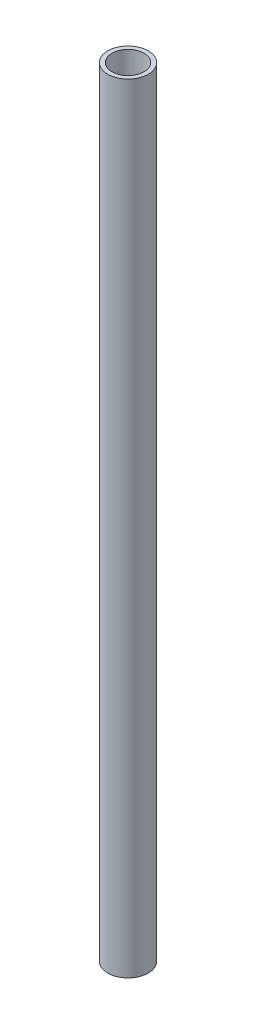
ISO-10303-21;
HEADER;
FILE_DESCRIPTION(('STEP AP214'),'2;1');
FILE_NAME('part.step','',(''),(''),'','','');
FILE_SCHEMA(('AUTOMOTIVE_DESIGN { 1 0 10303 214 1 1 1 1 }'));
ENDSEC;
DATA;
#1=APPLICATION_CONTEXT('core data for automotive mechanical design processes');
#2=APPLICATION_PROTOCOL_DEFINITION('international standard','automotive_design',2000,#1);
#3=PRODUCT_CONTEXT('',#1,'mechanical');
#4=PRODUCT('Part','Part','',(#3));
#5=PRODUCT_RELATED_PRODUCT_CATEGORY('part','',(#4));
#6=PRODUCT_DEFINITION_FORMATION('','',#4);
#7=PRODUCT_DEFINITION_CONTEXT('part definition',#1,'design');
#8=PRODUCT_DEFINITION('design','',#6,#7);
#9=PRODUCT_DEFINITION_SHAPE('','',#8);
#10=(LENGTH_UNIT() NAMED_UNIT(*) SI_UNIT(.MILLI.,.METRE.));
#11=(NAMED_UNIT(*) PLANE_ANGLE_UNIT() SI_UNIT($,.RADIAN.));
#12=(NAMED_UNIT(*) SI_UNIT($,.STERADIAN.) SOLID_ANGLE_UNIT());
#13=UNCERTAINTY_MEASURE_WITH_UNIT(LENGTH_MEASURE(1.E-05),#10,'distance_accuracy_value','');
#14=(GEOMETRIC_REPRESENTATION_CONTEXT(3) GLOBAL_UNCERTAINTY_ASSIGNED_CONTEXT((#13)) GLOBAL_UNIT_ASSIGNED_CONTEXT((#10,
#11,#12)) REPRESENTATION_CONTEXT('',''));
#15=CARTESIAN_POINT('',(0.,0.,0.));
#16=DIRECTION('',(0.,0.,1.));
#17=DIRECTION('',(1.,0.,0.));
#18=AXIS2_PLACEMENT_3D('',#15,#16,#17);
#19=CARTESIAN_POINT('',(0.,304.8,0.));
#20=DIRECTION('',(0.,1.,0.));
#21=DIRECTION('',(0.,0.,1.));
#22=AXIS2_PLACEMENT_3D('',#19,#20,#21);
#23=PLANE('',#22);
#24=CARTESIAN_POINT('',(0.,304.8,0.));
#25=DIRECTION('',(0.,1.,0.));
#26=DIRECTION('',(0.,0.,1.));
#27=AXIS2_PLACEMENT_3D('',#24,#25,#26);
#28=CIRCLE('',#27,7.9375);
#29=CARTESIAN_POINT('',(0.,304.8,-7.9375));
#30=VERTEX_POINT('',#29);
#31=EDGE_CURVE('E10',#30,#30,#28,.T.);
#32=ORIENTED_EDGE('',*,*,#31,.T.);
#33=EDGE_LOOP('',(#32));
#34=FACE_BOUND('',#33,.T.);
#35=CARTESIAN_POINT('',(0.,304.8,0.));
#36=DIRECTION('',(0.,1.,0.));
#37=DIRECTION('',(0.,0.,1.));
#38=AXIS2_PLACEMENT_3D('',#35,#36,#37);
#39=CIRCLE('',#38,6.2865);
#40=CARTESIAN_POINT('',(0.,304.8,-6.2865));
#41=VERTEX_POINT('',#40);
#42=EDGE_CURVE('E41',#41,#41,#39,.T.);
#43=ORIENTED_EDGE('',*,*,#42,.F.);
#44=EDGE_LOOP('',(#43));
#45=FACE_BOUND('',#44,.T.);
#46=ADVANCED_FACE('F30',(#34,#45),#23,.T.);
#47=CARTESIAN_POINT('',(0.,0.,0.));
#48=DIRECTION('',(0.,1.,0.));
#49=DIRECTION('',(0.,0.,1.));
#50=AXIS2_PLACEMENT_3D('',#47,#48,#49);
#51=PLANE('',#50);
#52=CARTESIAN_POINT('',(0.,0.,0.));
#53=DIRECTION('',(0.,1.,0.));
#54=DIRECTION('',(0.,0.,1.));
#55=AXIS2_PLACEMENT_3D('',#52,#53,#54);
#56=CIRCLE('',#55,7.9375);
#57=CARTESIAN_POINT('',(0.,0.,-7.9375));
#58=VERTEX_POINT('',#57);
#59=EDGE_CURVE('E34',#58,#58,#56,.T.);
#60=ORIENTED_EDGE('',*,*,#59,.F.);
#61=EDGE_LOOP('',(#60));
#62=FACE_BOUND('',#61,.T.);
#63=CARTESIAN_POINT('',(0.,0.,0.));
#64=DIRECTION('',(0.,1.,0.));
#65=DIRECTION('',(0.,0.,1.));
#66=AXIS2_PLACEMENT_3D('',#63,#64,#65);
#67=CIRCLE('',#66,6.2865);
#68=CARTESIAN_POINT('',(0.,0.,-6.2865));
#69=VERTEX_POINT('',#68);
#70=EDGE_CURVE('E43',#69,#69,#67,.T.);
#71=ORIENTED_EDGE('',*,*,#70,.T.);
#72=EDGE_LOOP('',(#71));
#73=FACE_BOUND('',#72,.T.);
#74=ADVANCED_FACE('F53',(#62,#73),#51,.F.);
#75=CARTESIAN_POINT('',(0.,304.8,0.));
#76=DIRECTION('',(0.,-1.,0.));
#77=DIRECTION('',(0.,0.,-1.));
#78=AXIS2_PLACEMENT_3D('',#75,#76,#77);
#79=CYLINDRICAL_SURFACE('',#78,7.9375);
#80=CARTESIAN_POINT('',(0.,304.8,-7.9375));
#81=CARTESIAN_POINT('',(0.,301.625,-7.9375));
#82=CARTESIAN_POINT('',(0.,298.45,-7.9375));
#83=CARTESIAN_POINT('',(0.,292.1,-7.9375));
#84=CARTESIAN_POINT('',(0.,288.925,-7.9375));
#85=CARTESIAN_POINT('',(0.,282.575,-7.9375));
#86=CARTESIAN_POINT('',(0.,279.4,-7.9375));
#87=CARTESIAN_POINT('',(0.,273.05,-7.9375));
#88=CARTESIAN_POINT('',(0.,269.875,-7.9375));
#89=CARTESIAN_POINT('',(0.,263.525,-7.9375));
#90=CARTESIAN_POINT('',(0.,260.35,-7.9375));
#91=CARTESIAN_POINT('',(0.,254.,-7.9375));
#92=CARTESIAN_POINT('',(0.,250.825,-7.9375));
#93=CARTESIAN_POINT('',(0.,244.475,-7.9375));
#94=CARTESIAN_POINT('',(0.,241.3,-7.9375));
#95=CARTESIAN_POINT('',(0.,234.95,-7.9375));
#96=CARTESIAN_POINT('',(0.,231.775,-7.9375));
#97=CARTESIAN_POINT('',(0.,225.425,-7.9375));
#98=CARTESIAN_POINT('',(0.,222.25,-7.9375));
#99=CARTESIAN_POINT('',(0.,215.9,-7.9375));
#100=CARTESIAN_POINT('',(0.,212.725,-7.9375));
#101=CARTESIAN_POINT('',(0.,206.375,-7.9375));
#102=CARTESIAN_POINT('',(0.,203.2,-7.9375));
#103=CARTESIAN_POINT('',(0.,196.85,-7.9375));
#104=CARTESIAN_POINT('',(0.,193.675,-7.9375));
#105=CARTESIAN_POINT('',(0.,187.325,-7.9375));
#106=CARTESIAN_POINT('',(0.,184.15,-7.9375));
#107=CARTESIAN_POINT('',(0.,177.8,-7.9375));
#108=CARTESIAN_POINT('',(0.,174.625,-7.9375));
#109=CARTESIAN_POINT('',(0.,168.275,-7.9375));
#110=CARTESIAN_POINT('',(0.,165.1,-7.9375));
#111=CARTESIAN_POINT('',(0.,158.75,-7.9375));
#112=CARTESIAN_POINT('',(0.,155.575,-7.9375));
#113=CARTESIAN_POINT('',(0.,149.225,-7.9375));
#114=CARTESIAN_POINT('',(0.,146.05,-7.9375));
#115=CARTESIAN_POINT('',(0.,139.7,-7.9375));
#116=CARTESIAN_POINT('',(0.,136.525,-7.9375));
#117=CARTESIAN_POINT('',(0.,130.175,-7.9375));
#118=CARTESIAN_POINT('',(0.,127.,-7.9375));
#119=CARTESIAN_POINT('',(0.,120.65,-7.9375));
#120=CARTESIAN_POINT('',(0.,117.475,-7.9375));
#121=CARTESIAN_POINT('',(0.,111.125,-7.9375));
#122=CARTESIAN_POINT('',(0.,107.95,-7.9375));
#123=CARTESIAN_POINT('',(0.,101.6,-7.9375));
#124=CARTESIAN_POINT('',(0.,98.425,-7.9375));
#125=CARTESIAN_POINT('',(0.,92.075,-7.9375));
#126=CARTESIAN_POINT('',(0.,88.9,-7.9375));
#127=CARTESIAN_POINT('',(0.,82.55,-7.9375));
#128=CARTESIAN_POINT('',(0.,79.375,-7.9375));
#129=CARTESIAN_POINT('',(0.,73.025,-7.9375));
#130=CARTESIAN_POINT('',(0.,69.85,-7.9375));
#131=CARTESIAN_POINT('',(0.,63.5,-7.9375));
#132=CARTESIAN_POINT('',(0.,60.325,-7.9375));
#133=CARTESIAN_POINT('',(0.,53.975,-7.9375));
#134=CARTESIAN_POINT('',(0.,50.8,-7.9375));
#135=CARTESIAN_POINT('',(0.,44.45,-7.9375));
#136=CARTESIAN_POINT('',(0.,41.275,-7.9375));
#137=CARTESIAN_POINT('',(0.,34.925,-7.9375));
#138=CARTESIAN_POINT('',(0.,31.75,-7.9375));
#139=CARTESIAN_POINT('',(0.,25.4,-7.9375));
#140=CARTESIAN_POINT('',(0.,22.225,-7.9375));
#141=CARTESIAN_POINT('',(0.,15.875,-7.9375));
#142=CARTESIAN_POINT('',(0.,12.7,-7.9375));
#143=CARTESIAN_POINT('',(0.,6.35,-7.9375));
#144=CARTESIAN_POINT('',(0.,3.175,-7.9375));
#145=CARTESIAN_POINT('',(0.,0.,-7.9375));
#146=B_SPLINE_CURVE_WITH_KNOTS('',3,(#80,#81,#82,#83,#84,#85,#86,#87,#88,#89,#90,#91,#92,#93,
#94,#95,#96,#97,#98,#99,#100,#101,#102,#103,#104,#105,#106,#107,#108,#109,#110,#111,#112,#113,
#114,#115,#116,#117,#118,#119,#120,#121,#122,#123,#124,#125,#126,#127,#128,#129,#130,#131,#132,
#133,#134,#135,#136,#137,#138,#139,#140,#141,#142,#143,#144,#145),.UNSPECIFIED.,.F.,.F.,(4,2,2,
2,2,2,2,2,2,2,2,2,2,2,2,2,2,2,2,2,2,2,2,2,2,2,2,2,2,2,2,2,4),(0.,9.52500000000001,19.05,28.575,
38.1,47.625,57.15,66.675,76.2,85.7250000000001,95.2500000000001,104.775,114.3,123.825,133.35,
142.875,152.4,161.925,171.45,180.975,190.5,200.025,209.55,219.075,228.6,238.125,247.65,257.175,
266.7,276.225,285.75,295.275,304.8),.UNSPECIFIED.);
#147=EDGE_CURVE('BSEAM32',#30,#58,#146,.T.);
#148=ORIENTED_EDGE('',*,*,#31,.F.);
#149=ORIENTED_EDGE('',*,*,#59,.T.);
#150=ORIENTED_EDGE('',*,*,#147,.T.);
#151=ORIENTED_EDGE('',*,*,#147,.F.);
#152=EDGE_LOOP('',(#148,#150,#149,#151));
#153=FACE_BOUND('',#152,.T.);
#154=ADVANCED_FACE('F32',(#153),#79,.T.);
#155=CARTESIAN_POINT('',(0.,304.8,0.));
#156=DIRECTION('',(0.,-1.,0.));
#157=DIRECTION('',(0.,0.,-1.));
#158=AXIS2_PLACEMENT_3D('',#155,#156,#157);
#159=CYLINDRICAL_SURFACE('',#158,6.2865);
#160=CARTESIAN_POINT('',(0.,304.8,-6.2865));
#161=CARTESIAN_POINT('',(0.,301.625,-6.2865));
#162=CARTESIAN_POINT('',(0.,298.45,-6.2865));
#163=CARTESIAN_POINT('',(0.,292.1,-6.2865));
#164=CARTESIAN_POINT('',(0.,288.925,-6.2865));
#165=CARTESIAN_POINT('',(0.,282.575,-6.2865));
#166=CARTESIAN_POINT('',(0.,279.4,-6.2865));
#167=CARTESIAN_POINT('',(0.,273.05,-6.2865));
#168=CARTESIAN_POINT('',(0.,269.875,-6.2865));
#169=CARTESIAN_POINT('',(0.,263.525,-6.2865));
#170=CARTESIAN_POINT('',(0.,260.35,-6.2865));
#171=CARTESIAN_POINT('',(0.,254.,-6.2865));
#172=CARTESIAN_POINT('',(0.,250.825,-6.2865));
#173=CARTESIAN_POINT('',(0.,244.475,-6.2865));
#174=CARTESIAN_POINT('',(0.,241.3,-6.2865));
#175=CARTESIAN_POINT('',(0.,234.95,-6.2865));
#176=CARTESIAN_POINT('',(0.,231.775,-6.2865));
#177=CARTESIAN_POINT('',(0.,225.425,-6.2865));
#178=CARTESIAN_POINT('',(0.,222.25,-6.2865));
#179=CARTESIAN_POINT('',(0.,215.9,-6.2865));
#180=CARTESIAN_POINT('',(0.,212.725,-6.2865));
#181=CARTESIAN_POINT('',(0.,206.375,-6.2865));
#182=CARTESIAN_POINT('',(0.,203.2,-6.2865));
#183=CARTESIAN_POINT('',(0.,196.85,-6.2865));
#184=CARTESIAN_POINT('',(0.,193.675,-6.2865));
#185=CARTESIAN_POINT('',(0.,187.325,-6.2865));
#186=CARTESIAN_POINT('',(0.,184.15,-6.2865));
#187=CARTESIAN_POINT('',(0.,177.8,-6.2865));
#188=CARTESIAN_POINT('',(0.,174.625,-6.2865));
#189=CARTESIAN_POINT('',(0.,168.275,-6.2865));
#190=CARTESIAN_POINT('',(0.,165.1,-6.2865));
#191=CARTESIAN_POINT('',(0.,158.75,-6.2865));
#192=CARTESIAN_POINT('',(0.,155.575,-6.2865));
#193=CARTESIAN_POINT('',(0.,149.225,-6.2865));
#194=CARTESIAN_POINT('',(0.,146.05,-6.2865));
#195=CARTESIAN_POINT('',(0.,139.7,-6.2865));
#196=CARTESIAN_POINT('',(0.,136.525,-6.2865));
#197=CARTESIAN_POINT('',(0.,130.175,-6.2865));
#198=CARTESIAN_POINT('',(0.,127.,-6.2865));
#199=CARTESIAN_POINT('',(0.,120.65,-6.2865));
#200=CARTESIAN_POINT('',(0.,117.475,-6.2865));
#201=CARTESIAN_POINT('',(0.,111.125,-6.2865));
#202=CARTESIAN_POINT('',(0.,107.95,-6.2865));
#203=CARTESIAN_POINT('',(0.,101.6,-6.2865));
#204=CARTESIAN_POINT('',(0.,98.425,-6.2865));
#205=CARTESIAN_POINT('',(0.,92.075,-6.2865));
#206=CARTESIAN_POINT('',(0.,88.9,-6.2865));
#207=CARTESIAN_POINT('',(0.,82.55,-6.2865));
#208=CARTESIAN_POINT('',(0.,79.375,-6.2865));
#209=CARTESIAN_POINT('',(0.,73.025,-6.2865));
#210=CARTESIAN_POINT('',(0.,69.85,-6.2865));
#211=CARTESIAN_POINT('',(0.,63.5,-6.2865));
#212=CARTESIAN_POINT('',(0.,60.325,-6.2865));
#213=CARTESIAN_POINT('',(0.,53.975,-6.2865));
#214=CARTESIAN_POINT('',(0.,50.8,-6.2865));
#215=CARTESIAN_POINT('',(0.,44.45,-6.2865));
#216=CARTESIAN_POINT('',(0.,41.275,-6.2865));
#217=CARTESIAN_POINT('',(0.,34.925,-6.2865));
#218=CARTESIAN_POINT('',(0.,31.75,-6.2865));
#219=CARTESIAN_POINT('',(0.,25.4,-6.2865));
#220=CARTESIAN_POINT('',(0.,22.225,-6.2865));
#221=CARTESIAN_POINT('',(0.,15.875,-6.2865));
#222=CARTESIAN_POINT('',(0.,12.7,-6.2865));
#223=CARTESIAN_POINT('',(0.,6.35,-6.2865));
#224=CARTESIAN_POINT('',(0.,3.175,-6.2865));
#225=CARTESIAN_POINT('',(0.,0.,-6.2865));
#226=B_SPLINE_CURVE_WITH_KNOTS('',3,(#160,#161,#162,#163,#164,#165,#166,#167,#168,#169,#170,
#171,#172,#173,#174,#175,#176,#177,#178,#179,#180,#181,#182,#183,#184,#185,#186,#187,#188,#189,
#190,#191,#192,#193,#194,#195,#196,#197,#198,#199,#200,#201,#202,#203,#204,#205,#206,#207,#208,
#209,#210,#211,#212,#213,#214,#215,#216,#217,#218,#219,#220,#221,#222,#223,#224,#225),
.UNSPECIFIED.,.F.,.F.,(4,2,2,2,2,2,2,2,2,2,2,2,2,2,2,2,2,2,2,2,2,2,2,2,2,2,2,2,2,2,2,2,4),(0.,
9.52500000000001,19.05,28.575,38.1,47.625,57.15,66.675,76.2,85.7250000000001,95.2500000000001,
104.775,114.3,123.825,133.35,142.875,152.4,161.925,171.45,180.975,190.5,200.025,209.55,219.075,
228.6,238.125,247.65,257.175,266.7,276.225,285.75,295.275,304.8),.UNSPECIFIED.);
#227=EDGE_CURVE('BSEAM49',#41,#69,#226,.T.);
#228=ORIENTED_EDGE('',*,*,#42,.T.);
#229=ORIENTED_EDGE('',*,*,#70,.F.);
#230=ORIENTED_EDGE('',*,*,#227,.T.);
#231=ORIENTED_EDGE('',*,*,#227,.F.);
#232=EDGE_LOOP('',(#228,#230,#229,#231));
#233=FACE_BOUND('',#232,.T.);
#234=ADVANCED_FACE('F49',(#233),#159,.F.);
#235=CLOSED_SHELL('',(#46,#74,#154,#234));
#236=MANIFOLD_SOLID_BREP('B2',#235);
#237=ADVANCED_BREP_SHAPE_REPRESENTATION('',(#18,#236),#14);
#238=SHAPE_DEFINITION_REPRESENTATION(#9,#237);
ENDSEC;
END-ISO-10303-21;
